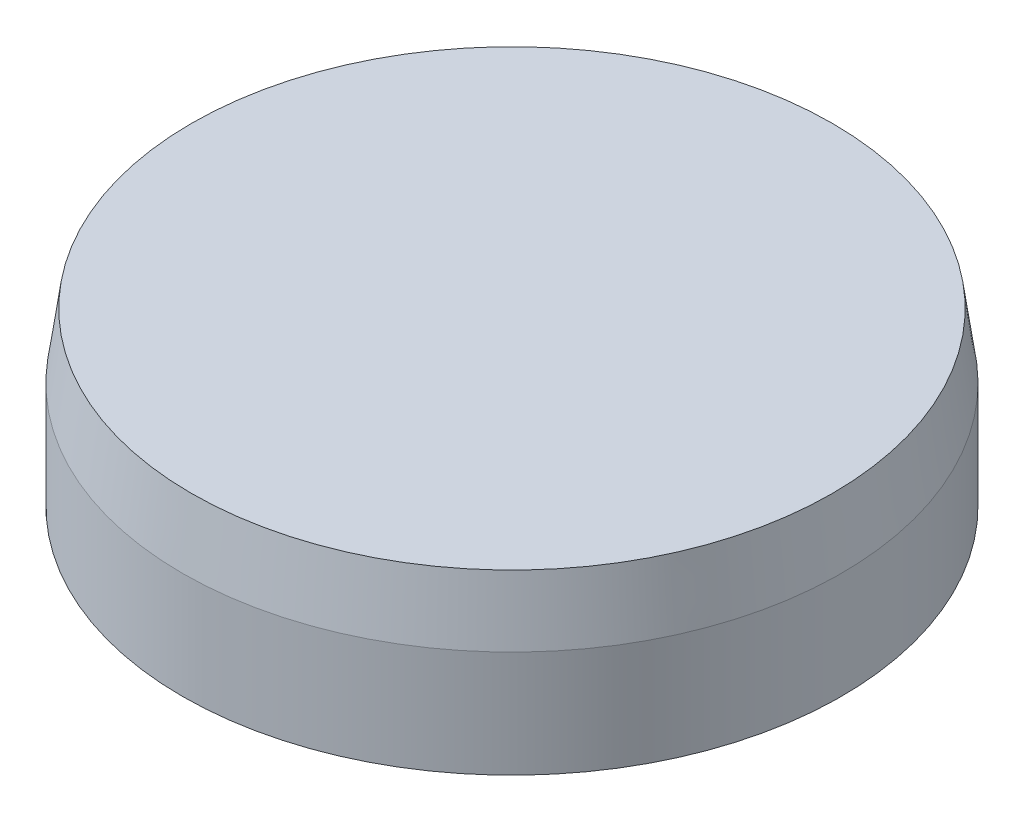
ISO-10303-21;
HEADER;
FILE_DESCRIPTION(('STEP AP214'),'2;1');
FILE_NAME('part.step','',(''),(''),'','','');
FILE_SCHEMA(('AUTOMOTIVE_DESIGN { 1 0 10303 214 1 1 1 1 }'));
ENDSEC;
DATA;
#1=APPLICATION_CONTEXT('core data for automotive mechanical design processes');
#2=APPLICATION_PROTOCOL_DEFINITION('international standard','automotive_design',2000,#1);
#3=PRODUCT_CONTEXT('',#1,'mechanical');
#4=PRODUCT('Part','Part','',(#3));
#5=PRODUCT_RELATED_PRODUCT_CATEGORY('part','',(#4));
#6=PRODUCT_DEFINITION_FORMATION('','',#4);
#7=PRODUCT_DEFINITION_CONTEXT('part definition',#1,'design');
#8=PRODUCT_DEFINITION('design','',#6,#7);
#9=PRODUCT_DEFINITION_SHAPE('','',#8);
#10=(LENGTH_UNIT() NAMED_UNIT(*) SI_UNIT(.MILLI.,.METRE.));
#11=(NAMED_UNIT(*) PLANE_ANGLE_UNIT() SI_UNIT($,.RADIAN.));
#12=(NAMED_UNIT(*) SI_UNIT($,.STERADIAN.) SOLID_ANGLE_UNIT());
#13=UNCERTAINTY_MEASURE_WITH_UNIT(LENGTH_MEASURE(1.E-05),#10,'distance_accuracy_value','');
#14=(GEOMETRIC_REPRESENTATION_CONTEXT(3) GLOBAL_UNCERTAINTY_ASSIGNED_CONTEXT((#13)) GLOBAL_UNIT_ASSIGNED_CONTEXT((#10,
#11,#12)) REPRESENTATION_CONTEXT('',''));
#15=CARTESIAN_POINT('',(0.,0.,0.));
#16=DIRECTION('',(0.,0.,1.));
#17=DIRECTION('',(1.,0.,0.));
#18=AXIS2_PLACEMENT_3D('',#15,#16,#17);
#19=CARTESIAN_POINT('',(0.,4.191,0.));
#20=DIRECTION('',(0.,1.,0.));
#21=DIRECTION('',(0.,0.,1.));
#22=AXIS2_PLACEMENT_3D('',#19,#20,#21);
#23=CONICAL_SURFACE('',#22,10.795,0.139626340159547);
#24=CARTESIAN_POINT('',(0.,4.191,0.));
#25=DIRECTION('',(0.,1.,0.));
#26=DIRECTION('',(0.,0.,1.));
#27=AXIS2_PLACEMENT_3D('',#24,#25,#26);
#28=CIRCLE('',#27,10.795);
#29=CARTESIAN_POINT('',(0.,4.191,10.795));
#30=VERTEX_POINT('',#29);
#31=EDGE_CURVE('E52',#30,#30,#28,.T.);
#32=ORIENTED_EDGE('',*,*,#31,.F.);
#33=EDGE_LOOP('',(#32));
#34=FACE_BOUND('',#33,.T.);
#35=CARTESIAN_POINT('',(0.,5.461,0.));
#36=DIRECTION('',(0.,1.,0.));
#37=DIRECTION('',(0.,0.,1.));
#38=AXIS2_PLACEMENT_3D('',#35,#36,#37);
#39=CIRCLE('',#38,10.973486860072);
#40=CARTESIAN_POINT('',(0.,5.461,10.973486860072));
#41=VERTEX_POINT('',#40);
#42=EDGE_CURVE('E36',#41,#41,#39,.T.);
#43=ORIENTED_EDGE('',*,*,#42,.T.);
#44=EDGE_LOOP('',(#43));
#45=FACE_BOUND('',#44,.T.);
#46=ADVANCED_FACE('F32',(#34,#45),#23,.F.);
#47=CARTESIAN_POINT('',(0.,0.,0.));
#48=DIRECTION('',(0.,1.,0.));
#49=DIRECTION('',(0.,0.,1.));
#50=AXIS2_PLACEMENT_3D('',#47,#48,#49);
#51=PLANE('',#50);
#52=CARTESIAN_POINT('',(0.,0.,0.));
#53=DIRECTION('',(0.,1.,0.));
#54=DIRECTION('',(0.,0.,1.));
#55=AXIS2_PLACEMENT_3D('',#52,#53,#54);
#56=CIRCLE('',#55,12.954);
#57=CARTESIAN_POINT('',(0.,0.,12.954));
#58=VERTEX_POINT('',#57);
#59=EDGE_CURVE('E40',#58,#58,#56,.T.);
#60=ORIENTED_EDGE('',*,*,#59,.F.);
#61=EDGE_LOOP('',(#60));
#62=FACE_BOUND('',#61,.T.);
#63=CARTESIAN_POINT('',(0.,0.,0.));
#64=DIRECTION('',(0.,1.,0.));
#65=DIRECTION('',(0.,0.,1.));
#66=AXIS2_PLACEMENT_3D('',#63,#64,#65);
#67=CIRCLE('',#66,10.795);
#68=CARTESIAN_POINT('',(0.,0.,10.795));
#69=VERTEX_POINT('',#68);
#70=EDGE_CURVE('E44',#69,#69,#67,.T.);
#71=ORIENTED_EDGE('',*,*,#70,.T.);
#72=EDGE_LOOP('',(#71));
#73=FACE_BOUND('',#72,.T.);
#74=ADVANCED_FACE('F73',(#62,#73),#51,.F.);
#75=CARTESIAN_POINT('',(0.,4.191,0.));
#76=DIRECTION('',(0.,-1.,0.));
#77=DIRECTION('',(0.,0.,-1.));
#78=AXIS2_PLACEMENT_3D('',#75,#76,#77);
#79=CYLINDRICAL_SURFACE('',#78,12.954);
#80=CARTESIAN_POINT('',(0.,4.191,0.));
#81=DIRECTION('',(0.,1.,0.));
#82=DIRECTION('',(0.,0.,1.));
#83=AXIS2_PLACEMENT_3D('',#80,#81,#82);
#84=CIRCLE('',#83,12.954);
#85=CARTESIAN_POINT('',(0.,4.191,12.954));
#86=VERTEX_POINT('',#85);
#87=EDGE_CURVE('E10',#86,#86,#84,.T.);
#88=ORIENTED_EDGE('',*,*,#87,.F.);
#89=EDGE_LOOP('',(#88));
#90=FACE_BOUND('',#89,.T.);
#91=ORIENTED_EDGE('',*,*,#59,.T.);
#92=EDGE_LOOP('',(#91));
#93=FACE_BOUND('',#92,.T.);
#94=ADVANCED_FACE('F34',(#90,#93),#79,.T.);
#95=CARTESIAN_POINT('',(0.,4.191,0.));
#96=DIRECTION('',(0.,-1.,0.));
#97=DIRECTION('',(0.,0.,-1.));
#98=AXIS2_PLACEMENT_3D('',#95,#96,#97);
#99=CYLINDRICAL_SURFACE('',#98,10.795);
#100=ORIENTED_EDGE('',*,*,#31,.T.);
#101=EDGE_LOOP('',(#100));
#102=FACE_BOUND('',#101,.T.);
#103=ORIENTED_EDGE('',*,*,#70,.F.);
#104=EDGE_LOOP('',(#103));
#105=FACE_BOUND('',#104,.T.);
#106=ADVANCED_FACE('F82',(#102,#105),#99,.F.);
#107=CARTESIAN_POINT('',(0.,6.731,0.));
#108=DIRECTION('',(0.,1.,0.));
#109=DIRECTION('',(0.,0.,1.));
#110=AXIS2_PLACEMENT_3D('',#107,#108,#109);
#111=PLANE('',#110);
#112=CARTESIAN_POINT('',(0.,6.731,0.));
#113=DIRECTION('',(0.,1.,0.));
#114=DIRECTION('',(0.,0.,1.));
#115=AXIS2_PLACEMENT_3D('',#112,#113,#114);
#116=CIRCLE('',#115,12.5970262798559);
#117=CARTESIAN_POINT('',(0.,6.731,12.5970262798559));
#118=VERTEX_POINT('',#117);
#119=EDGE_CURVE('E49',#118,#118,#116,.T.);
#120=ORIENTED_EDGE('',*,*,#119,.T.);
#121=EDGE_LOOP('',(#120));
#122=FACE_BOUND('',#121,.T.);
#123=ADVANCED_FACE('F68',(#122),#111,.T.);
#124=CARTESIAN_POINT('',(0.,4.191,0.));
#125=DIRECTION('',(0.,-1.,0.));
#126=DIRECTION('',(0.,0.,1.));
#127=AXIS2_PLACEMENT_3D('',#124,#125,#126);
#128=CONICAL_SURFACE('',#127,12.954,0.139626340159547);
#129=ORIENTED_EDGE('',*,*,#119,.F.);
#130=EDGE_LOOP('',(#129));
#131=FACE_BOUND('',#130,.T.);
#132=ORIENTED_EDGE('',*,*,#87,.T.);
#133=EDGE_LOOP('',(#132));
#134=FACE_BOUND('',#133,.T.);
#135=ADVANCED_FACE('F62',(#131,#134),#128,.T.);
#136=CARTESIAN_POINT('',(0.,5.461,0.));
#137=DIRECTION('',(0.,1.,0.));
#138=DIRECTION('',(0.,0.,1.));
#139=AXIS2_PLACEMENT_3D('',#136,#137,#138);
#140=PLANE('',#139);
#141=ORIENTED_EDGE('',*,*,#42,.F.);
#142=EDGE_LOOP('',(#141));
#143=FACE_BOUND('',#142,.T.);
#144=ADVANCED_FACE('F60',(#143),#140,.F.);
#145=CLOSED_SHELL('',(#46,#74,#94,#106,#123,#135,#144));
#146=MANIFOLD_SOLID_BREP('B2',#145);
#147=ADVANCED_BREP_SHAPE_REPRESENTATION('',(#18,#146),#14);
#148=SHAPE_DEFINITION_REPRESENTATION(#9,#147);
ENDSEC;
END-ISO-10303-21;
